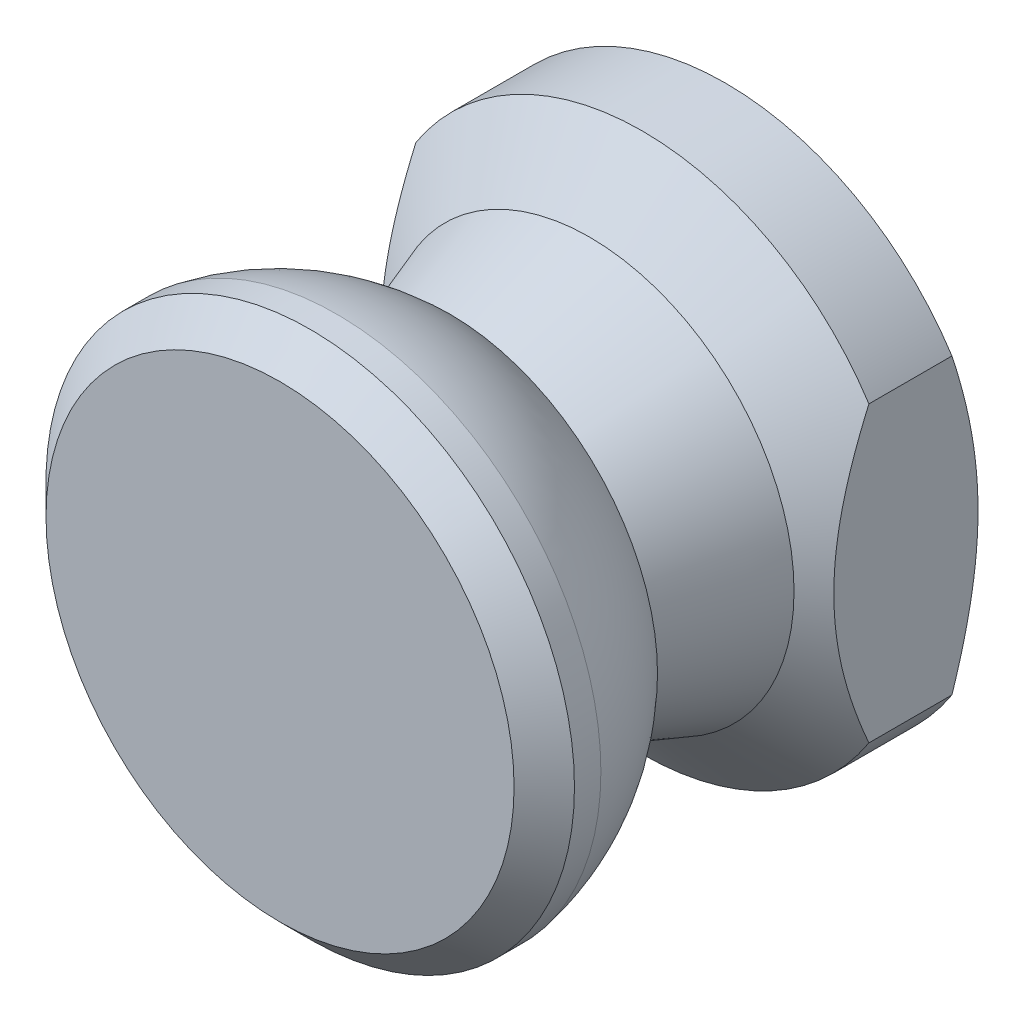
ISO-10303-21;
HEADER;
FILE_DESCRIPTION(('STEP AP214'),'2;1');
FILE_NAME('part.step','',(''),(''),'','','');
FILE_SCHEMA(('AUTOMOTIVE_DESIGN { 1 0 10303 214 1 1 1 1 }'));
ENDSEC;
DATA;
#1=APPLICATION_CONTEXT('core data for automotive mechanical design processes');
#2=APPLICATION_PROTOCOL_DEFINITION('international standard','automotive_design',2000,#1);
#3=PRODUCT_CONTEXT('',#1,'mechanical');
#4=PRODUCT('Part','Part','',(#3));
#5=PRODUCT_RELATED_PRODUCT_CATEGORY('part','',(#4));
#6=PRODUCT_DEFINITION_FORMATION('','',#4);
#7=PRODUCT_DEFINITION_CONTEXT('part definition',#1,'design');
#8=PRODUCT_DEFINITION('design','',#6,#7);
#9=PRODUCT_DEFINITION_SHAPE('','',#8);
#10=(LENGTH_UNIT() NAMED_UNIT(*) SI_UNIT(.MILLI.,.METRE.));
#11=(NAMED_UNIT(*) PLANE_ANGLE_UNIT() SI_UNIT($,.RADIAN.));
#12=(NAMED_UNIT(*) SI_UNIT($,.STERADIAN.) SOLID_ANGLE_UNIT());
#13=UNCERTAINTY_MEASURE_WITH_UNIT(LENGTH_MEASURE(1.E-05),#10,'distance_accuracy_value','');
#14=(GEOMETRIC_REPRESENTATION_CONTEXT(3) GLOBAL_UNCERTAINTY_ASSIGNED_CONTEXT((#13)) GLOBAL_UNIT_ASSIGNED_CONTEXT((#10,
#11,#12)) REPRESENTATION_CONTEXT('',''));
#15=CARTESIAN_POINT('',(0.,0.,0.));
#16=DIRECTION('',(0.,0.,1.));
#17=DIRECTION('',(1.,0.,0.));
#18=AXIS2_PLACEMENT_3D('',#15,#16,#17);
#19=CARTESIAN_POINT('',(0.,0.,15.5));
#20=DIRECTION('',(0.,0.,1.));
#21=DIRECTION('',(1.,0.,0.));
#22=AXIS2_PLACEMENT_3D('',#19,#20,#21);
#23=CYLINDRICAL_SURFACE('',#22,7.15);
#24=DIRECTION('',(0.,0.,1.));
#25=VECTOR('',#24,1.);
#26=CARTESIAN_POINT('',(-6.,3.88876587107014,15.5));
#27=LINE('',#26,#25);
#28=CARTESIAN_POINT('',(-6.,3.88876587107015,3.4));
#29=VERTEX_POINT('',#28);
#30=CARTESIAN_POINT('',(-6.,3.88876587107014,1.2));
#31=VERTEX_POINT('',#30);
#32=EDGE_CURVE('E60',#29,#31,#27,.F.);
#33=ORIENTED_EDGE('',*,*,#32,.F.);
#34=CARTESIAN_POINT('',(0.,0.,3.4));
#35=DIRECTION('',(0.,0.,1.));
#36=DIRECTION('',(1.,0.,0.));
#37=AXIS2_PLACEMENT_3D('',#34,#35,#36);
#38=CIRCLE('',#37,7.15);
#39=CARTESIAN_POINT('',(6.,3.88876587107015,3.4));
#40=VERTEX_POINT('',#39);
#41=EDGE_CURVE('E68',#40,#29,#38,.T.);
#42=ORIENTED_EDGE('',*,*,#41,.F.);
#43=DIRECTION('',(0.,0.,1.));
#44=VECTOR('',#43,1.);
#45=CARTESIAN_POINT('',(6.,3.88876587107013,15.5));
#46=LINE('',#45,#44);
#47=CARTESIAN_POINT('',(6.,3.88876587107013,1.2));
#48=VERTEX_POINT('',#47);
#49=EDGE_CURVE('E42',#48,#40,#46,.T.);
#50=ORIENTED_EDGE('',*,*,#49,.F.);
#51=CARTESIAN_POINT('',(0.,0.,1.20000000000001));
#52=DIRECTION('',(0.,0.,1.));
#53=DIRECTION('',(1.,0.,0.));
#54=AXIS2_PLACEMENT_3D('',#51,#52,#53);
#55=CIRCLE('',#54,7.15);
#56=EDGE_CURVE('E70',#48,#31,#55,.T.);
#57=ORIENTED_EDGE('',*,*,#56,.T.);
#58=EDGE_LOOP('',(#33,#42,#50,#57));
#59=FACE_BOUND('',#58,.T.);
#60=ADVANCED_FACE('F14',(#59),#23,.T.);
#61=CARTESIAN_POINT('',(3.,0.,0.));
#62=DIRECTION('',(0.,0.,-1.));
#63=DIRECTION('',(-1.,0.,0.));
#64=AXIS2_PLACEMENT_3D('',#61,#62,#63);
#65=PLANE('',#64);
#66=CARTESIAN_POINT('',(0.,0.,0.));
#67=DIRECTION('',(0.,0.,1.));
#68=DIRECTION('',(1.,0.,0.));
#69=AXIS2_PLACEMENT_3D('',#66,#67,#68);
#70=CIRCLE('',#69,3.);
#71=CARTESIAN_POINT('',(3.,0.,0.));
#72=VERTEX_POINT('',#71);
#73=EDGE_CURVE('E141',#72,#72,#70,.T.);
#74=ORIENTED_EDGE('',*,*,#73,.T.);
#75=EDGE_LOOP('',(#74));
#76=FACE_BOUND('',#75,.T.);
#77=CARTESIAN_POINT('',(0.,0.,0.));
#78=DIRECTION('',(0.,0.,1.));
#79=DIRECTION('',(1.,0.,0.));
#80=AXIS2_PLACEMENT_3D('',#77,#78,#79);
#81=CIRCLE('',#80,5.15);
#82=CARTESIAN_POINT('',(5.15,0.,0.));
#83=VERTEX_POINT('',#82);
#84=EDGE_CURVE('E83',#83,#83,#81,.T.);
#85=ORIENTED_EDGE('',*,*,#84,.F.);
#86=EDGE_LOOP('',(#85));
#87=FACE_BOUND('',#86,.T.);
#88=ADVANCED_FACE('F16',(#76,#87),#65,.T.);
#89=CARTESIAN_POINT('',(0.,0.,1.20000000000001));
#90=DIRECTION('',(0.,0.,1.));
#91=DIRECTION('',(1.,0.,0.));
#92=AXIS2_PLACEMENT_3D('',#89,#90,#91);
#93=CONICAL_SURFACE('',#92,7.15,1.03037682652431);
#94=CARTESIAN_POINT('',(-6.,-10.2804051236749,4.05193409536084));
#95=CARTESIAN_POINT('',(-6.,-10.0101252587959,3.91190550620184));
#96=CARTESIAN_POINT('',(-6.,-9.73929005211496,3.77293434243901));
#97=CARTESIAN_POINT('',(-6.,-9.19621625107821,3.49768733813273));
#98=CARTESIAN_POINT('',(-6.,-8.92397750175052,3.36141180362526));
#99=CARTESIAN_POINT('',(-6.,-8.37674762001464,3.09161761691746));
#100=CARTESIAN_POINT('',(-6.,-8.10174978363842,2.95811252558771));
#101=CARTESIAN_POINT('',(-6.,-7.54977127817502,2.69528259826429));
#102=CARTESIAN_POINT('',(-6.,-7.2727906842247,2.56595760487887));
#103=CARTESIAN_POINT('',(-6.,-6.70311560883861,2.30652249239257));
#104=CARTESIAN_POINT('',(-6.,-6.41030304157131,2.17667052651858));
#105=CARTESIAN_POINT('',(-6.,-5.82141885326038,1.92444844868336));
#106=CARTESIAN_POINT('',(-6.,-5.52534690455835,1.80207909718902));
#107=CARTESIAN_POINT('',(-6.00000000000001,-4.92975194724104,1.56733308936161));
#108=CARTESIAN_POINT('',(-6.00000000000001,-4.63023480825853,1.45494165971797));
#109=CARTESIAN_POINT('',(-6.,-4.02669661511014,1.24308099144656));
#110=CARTESIAN_POINT('',(-6.,-3.72267677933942,1.14360832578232));
#111=CARTESIAN_POINT('',(-6.,-3.11218998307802,0.962376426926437));
#112=CARTESIAN_POINT('',(-6.,-2.80576682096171,0.880471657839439));
#113=CARTESIAN_POINT('',(-6.00000000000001,-2.18787306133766,0.738061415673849));
#114=CARTESIAN_POINT('',(-6.00000000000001,-1.8764032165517,0.677552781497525));
#115=CARTESIAN_POINT('',(-6.00000000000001,-1.40883799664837,0.606823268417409));
#116=CARTESIAN_POINT('',(-6.00000000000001,-1.25421690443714,0.586673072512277));
#117=CARTESIAN_POINT('',(-6.00000000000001,-0.944247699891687,0.55316085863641));
#118=CARTESIAN_POINT('',(-6.00000000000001,-0.788899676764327,0.539798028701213));
#119=CARTESIAN_POINT('',(-6.00000000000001,-0.477751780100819,0.520201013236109));
#120=CARTESIAN_POINT('',(-6.00000000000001,-0.321951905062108,0.513966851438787));
#121=CARTESIAN_POINT('',(-6.,-0.0102294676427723,0.508791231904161));
#122=CARTESIAN_POINT('',(-6.,0.145693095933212,0.509849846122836));
#123=CARTESIAN_POINT('',(-6.,0.466240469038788,0.519503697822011));
#124=CARTESIAN_POINT('',(-6.,0.630852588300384,0.528526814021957));
#125=CARTESIAN_POINT('',(-6.00000000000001,0.959443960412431,0.55442406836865));
#126=CARTESIAN_POINT('',(-6.00000000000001,1.12342320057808,0.571298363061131));
#127=CARTESIAN_POINT('',(-6.00000000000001,1.6139969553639,0.6330449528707));
#128=CARTESIAN_POINT('',(-6.00000000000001,1.93924359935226,0.689041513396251));
#129=CARTESIAN_POINT('',(-6.00000000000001,2.42660923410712,0.792166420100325));
#130=CARTESIAN_POINT('',(-6.00000000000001,2.59076121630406,0.830252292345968));
#131=CARTESIAN_POINT('',(-6.00000000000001,2.9176629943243,0.912082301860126));
#132=CARTESIAN_POINT('',(-6.00000000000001,3.08041277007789,0.955826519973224));
#133=CARTESIAN_POINT('',(-6.00000000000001,3.40448415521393,1.04826779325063));
#134=CARTESIAN_POINT('',(-6.00000000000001,3.5658057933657,1.09696474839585));
#135=CARTESIAN_POINT('',(-6.,3.88706768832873,1.19866598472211));
#136=CARTESIAN_POINT('',(-6.,4.04700803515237,1.25166998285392));
#137=CARTESIAN_POINT('',(-6.,4.57938707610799,1.43501686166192));
#138=CARTESIAN_POINT('',(-6.,4.94896086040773,1.57369296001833));
#139=CARTESIAN_POINT('',(-6.00000000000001,5.68238513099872,1.86551627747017));
#140=CARTESIAN_POINT('',(-6.00000000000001,6.04623362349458,2.01866841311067));
#141=CARTESIAN_POINT('',(-6.,6.76975478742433,2.33555397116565));
#142=CARTESIAN_POINT('',(-6.,7.1294223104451,2.49929908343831));
#143=CARTESIAN_POINT('',(-6.,7.84511641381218,2.83439934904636));
#144=CARTESIAN_POINT('',(-6.,8.20114345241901,3.00575352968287));
#145=CARTESIAN_POINT('',(-6.,8.91188025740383,3.35490071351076));
#146=CARTESIAN_POINT('',(-6.,9.26657814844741,3.53271780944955));
#147=CARTESIAN_POINT('',(-6.,9.97374650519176,3.89273820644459));
#148=CARTESIAN_POINT('',(-6.,10.3262169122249,4.07494162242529));
#149=CARTESIAN_POINT('',(-6.,11.0291543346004,4.44263223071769));
#150=CARTESIAN_POINT('',(-6.,11.3796224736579,4.62811727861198));
#151=CARTESIAN_POINT('',(-6.,12.0791194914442,5.00176971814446));
#152=CARTESIAN_POINT('',(-6.,12.4281483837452,5.18993708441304));
#153=CARTESIAN_POINT('',(-6.,13.3799615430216,5.70685282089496));
#154=CARTESIAN_POINT('',(-6.,13.9815845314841,6.03773845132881));
#155=CARTESIAN_POINT('',(-6.,15.1824389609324,6.70406103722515));
#156=CARTESIAN_POINT('',(-6.,15.7816699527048,7.03949879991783));
#157=CARTESIAN_POINT('',(-6.,16.973504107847,7.7109697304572));
#158=CARTESIAN_POINT('',(-6.,17.5661219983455,8.04697677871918));
#159=CARTESIAN_POINT('',(-6.,18.4539477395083,8.55277746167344));
#160=CARTESIAN_POINT('',(-6.,18.7496761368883,8.72165878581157));
#161=CARTESIAN_POINT('',(-6.,19.3408253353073,9.05995778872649));
#162=CARTESIAN_POINT('',(-6.,19.636246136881,9.22937546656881));
#163=CARTESIAN_POINT('',(-6.,19.9315332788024,9.39902585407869));
#164=B_SPLINE_CURVE_WITH_KNOTS('',3,(#94,#95,#96,#97,#98,#99,#100,#101,#102,#103,#104,#105,#106,
#107,#108,#109,#110,#111,#112,#113,#114,#115,#116,#117,#118,#119,#120,#121,#122,#123,#124,#125,
#126,#127,#128,#129,#130,#131,#132,#133,#134,#135,#136,#137,#138,#139,#140,#141,#142,#143,#144,
#145,#146,#147,#148,#149,#150,#151,#152,#153,#154,#155,#156,#157,#158,#159,#160,#161,#162,#163),
.UNSPECIFIED.,.F.,.F.,(4,2,2,2,2,2,2,2,2,2,2,2,2,2,2,2,2,2,2,2,2,2,2,2,2,2,2,2,2,2,2,2,2,2,4),
(0.,0.913206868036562,1.82651682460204,2.74356353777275,3.66057568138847,4.62143647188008,
5.58239475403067,6.54190564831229,7.50116148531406,8.45213430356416,9.4029665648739,
9.87062638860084,10.3382302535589,10.8058356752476,11.2734457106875,11.7678186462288,
12.262201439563,13.2509188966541,13.7563888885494,14.2618661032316,14.7673331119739,
15.2727669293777,16.4564716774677,17.6405799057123,18.8260179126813,20.011304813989,
21.2015870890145,22.3919005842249,23.5814630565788,24.7710142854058,26.8308179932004,
28.8909918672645,30.9347229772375,31.9563808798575,32.9780370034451),.UNSPECIFIED.);
#165=CARTESIAN_POINT('',(-6.,-3.88876587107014,1.2));
#166=VERTEX_POINT('',#165);
#167=EDGE_CURVE('E71',#31,#166,#164,.F.);
#168=ORIENTED_EDGE('',*,*,#167,.F.);
#169=ORIENTED_EDGE('',*,*,#56,.F.);
#170=CARTESIAN_POINT('',(6.,-10.2804051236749,4.05193409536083));
#171=CARTESIAN_POINT('',(6.,-10.0101252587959,3.91190550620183));
#172=CARTESIAN_POINT('',(6.,-9.73929005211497,3.77293434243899));
#173=CARTESIAN_POINT('',(6.,-9.19621625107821,3.49768733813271));
#174=CARTESIAN_POINT('',(6.,-8.92397750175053,3.36141180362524));
#175=CARTESIAN_POINT('',(6.,-8.37674762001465,3.09161761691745));
#176=CARTESIAN_POINT('',(6.,-8.10174978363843,2.9581125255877));
#177=CARTESIAN_POINT('',(6.,-7.54977127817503,2.69528259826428));
#178=CARTESIAN_POINT('',(6.,-7.27279068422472,2.56595760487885));
#179=CARTESIAN_POINT('',(6.,-6.70311560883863,2.30652249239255));
#180=CARTESIAN_POINT('',(6.,-6.41030304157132,2.17667052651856));
#181=CARTESIAN_POINT('',(6.,-5.82141885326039,1.92444844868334));
#182=CARTESIAN_POINT('',(6.,-5.52534690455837,1.802079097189));
#183=CARTESIAN_POINT('',(5.99999999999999,-4.92975194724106,1.56733308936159));
#184=CARTESIAN_POINT('',(5.99999999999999,-4.63023480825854,1.45494165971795));
#185=CARTESIAN_POINT('',(6.,-4.02669661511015,1.24308099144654));
#186=CARTESIAN_POINT('',(6.,-3.72267677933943,1.14360832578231));
#187=CARTESIAN_POINT('',(6.,-3.11218998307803,0.962376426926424));
#188=CARTESIAN_POINT('',(6.,-2.80576682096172,0.880471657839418));
#189=CARTESIAN_POINT('',(5.99999999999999,-2.18787306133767,0.738061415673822));
#190=CARTESIAN_POINT('',(5.99999999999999,-1.87640321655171,0.6775527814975));
#191=CARTESIAN_POINT('',(5.99999999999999,-1.40883799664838,0.606823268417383));
#192=CARTESIAN_POINT('',(5.99999999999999,-1.25421690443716,0.58667307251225));
#193=CARTESIAN_POINT('',(5.99999999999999,-0.944247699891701,0.553160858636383));
#194=CARTESIAN_POINT('',(5.99999999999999,-0.788899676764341,0.539798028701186));
#195=CARTESIAN_POINT('',(5.99999999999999,-0.477751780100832,0.520201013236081));
#196=CARTESIAN_POINT('',(5.99999999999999,-0.321951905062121,0.513966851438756));
#197=CARTESIAN_POINT('',(6.,-0.0102294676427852,0.508791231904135));
#198=CARTESIAN_POINT('',(6.,0.145693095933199,0.509849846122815));
#199=CARTESIAN_POINT('',(6.,0.466240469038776,0.51950369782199));
#200=CARTESIAN_POINT('',(6.,0.630852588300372,0.52852681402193));
#201=CARTESIAN_POINT('',(5.99999999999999,0.95944396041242,0.554424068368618));
#202=CARTESIAN_POINT('',(5.99999999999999,1.12342320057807,0.5712983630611));
#203=CARTESIAN_POINT('',(5.99999999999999,1.61399695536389,0.633044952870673));
#204=CARTESIAN_POINT('',(5.99999999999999,1.93924359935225,0.689041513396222));
#205=CARTESIAN_POINT('',(5.99999999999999,2.42660923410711,0.792166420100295));
#206=CARTESIAN_POINT('',(5.99999999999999,2.59076121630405,0.830252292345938));
#207=CARTESIAN_POINT('',(5.99999999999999,2.91766299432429,0.912082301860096));
#208=CARTESIAN_POINT('',(5.99999999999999,3.08041277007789,0.955826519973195));
#209=CARTESIAN_POINT('',(5.99999999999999,3.40448415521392,1.0482677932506));
#210=CARTESIAN_POINT('',(5.99999999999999,3.56580579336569,1.09696474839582));
#211=CARTESIAN_POINT('',(6.,3.88706768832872,1.19866598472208));
#212=CARTESIAN_POINT('',(6.,4.04700803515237,1.2516699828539));
#213=CARTESIAN_POINT('',(6.,4.57938707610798,1.4350168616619));
#214=CARTESIAN_POINT('',(6.,4.94896086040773,1.57369296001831));
#215=CARTESIAN_POINT('',(5.99999999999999,5.68238513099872,1.86551627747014));
#216=CARTESIAN_POINT('',(5.99999999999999,6.04623362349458,2.01866841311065));
#217=CARTESIAN_POINT('',(6.,6.76975478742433,2.33555397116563));
#218=CARTESIAN_POINT('',(6.,7.1294223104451,2.49929908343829));
#219=CARTESIAN_POINT('',(6.,7.84511641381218,2.83439934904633));
#220=CARTESIAN_POINT('',(6.,8.20114345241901,3.00575352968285));
#221=CARTESIAN_POINT('',(6.,8.91188025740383,3.35490071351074));
#222=CARTESIAN_POINT('',(6.,9.26657814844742,3.53271780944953));
#223=CARTESIAN_POINT('',(6.,9.97374650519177,3.89273820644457));
#224=CARTESIAN_POINT('',(6.,10.3262169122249,4.07494162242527));
#225=CARTESIAN_POINT('',(6.,11.0291543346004,4.44263223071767));
#226=CARTESIAN_POINT('',(6.,11.3796224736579,4.62811727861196));
#227=CARTESIAN_POINT('',(6.,12.0791194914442,5.00176971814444));
#228=CARTESIAN_POINT('',(6.,12.4281483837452,5.18993708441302));
#229=CARTESIAN_POINT('',(6.,13.3799615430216,5.70685282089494));
#230=CARTESIAN_POINT('',(6.,13.9815845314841,6.03773845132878));
#231=CARTESIAN_POINT('',(6.,15.1824389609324,6.70406103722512));
#232=CARTESIAN_POINT('',(6.,15.7816699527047,7.03949879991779));
#233=CARTESIAN_POINT('',(6.,16.9735041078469,7.71096973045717));
#234=CARTESIAN_POINT('',(6.,17.5661219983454,8.04697677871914));
#235=CARTESIAN_POINT('',(6.,18.4539477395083,8.5527774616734));
#236=CARTESIAN_POINT('',(6.,18.7496761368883,8.72165878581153));
#237=CARTESIAN_POINT('',(6.,19.3408253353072,9.05995778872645));
#238=CARTESIAN_POINT('',(6.,19.636246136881,9.22937546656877));
#239=CARTESIAN_POINT('',(6.,19.9315332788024,9.39902585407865));
#240=B_SPLINE_CURVE_WITH_KNOTS('',3,(#170,#171,#172,#173,#174,#175,#176,#177,#178,#179,#180,
#181,#182,#183,#184,#185,#186,#187,#188,#189,#190,#191,#192,#193,#194,#195,#196,#197,#198,#199,
#200,#201,#202,#203,#204,#205,#206,#207,#208,#209,#210,#211,#212,#213,#214,#215,#216,#217,#218,
#219,#220,#221,#222,#223,#224,#225,#226,#227,#228,#229,#230,#231,#232,#233,#234,#235,#236,#237,
#238,#239),.UNSPECIFIED.,.F.,.F.,(4,2,2,2,2,2,2,2,2,2,2,2,2,2,2,2,2,2,2,2,2,2,2,2,2,2,2,2,2,2,2,
2,2,2,4),(0.,0.913206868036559,1.82651682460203,2.74356353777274,3.66057568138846,
4.62143647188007,5.58239475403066,6.54190564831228,7.50116148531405,8.45213430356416,
9.40296656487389,9.87062638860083,10.3382302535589,10.8058356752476,11.2734457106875,
11.7678186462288,12.262201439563,13.250918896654,13.7563888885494,14.2618661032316,
14.7673331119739,15.2727669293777,16.4564716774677,17.6405799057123,18.8260179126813,
20.011304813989,21.2015870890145,22.3919005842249,23.5814630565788,24.7710142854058,
26.8308179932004,28.8909918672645,30.9347229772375,31.9563808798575,32.978037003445),.UNSPECIFIED.);
#241=CARTESIAN_POINT('',(6.,-3.88876587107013,1.2));
#242=VERTEX_POINT('',#241);
#243=EDGE_CURVE('E109',#242,#48,#240,.T.);
#244=ORIENTED_EDGE('',*,*,#243,.F.);
#245=EDGE_CURVE('E75',#166,#242,#55,.T.);
#246=ORIENTED_EDGE('',*,*,#245,.F.);
#247=EDGE_LOOP('',(#168,#169,#244,#246));
#248=FACE_BOUND('',#247,.T.);
#249=ORIENTED_EDGE('',*,*,#84,.T.);
#250=EDGE_LOOP('',(#249));
#251=FACE_BOUND('',#250,.T.);
#252=ADVANCED_FACE('F102',(#248,#251),#93,.T.);
#253=DIRECTION('',(0.,0.,1.));
#254=VECTOR('',#253,1.);
#255=CARTESIAN_POINT('',(-6.,-3.88876587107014,15.5));
#256=LINE('',#255,#254);
#257=CARTESIAN_POINT('',(-6.,-3.88876587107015,3.4));
#258=VERTEX_POINT('',#257);
#259=EDGE_CURVE('E34',#166,#258,#256,.T.);
#260=ORIENTED_EDGE('',*,*,#259,.F.);
#261=ORIENTED_EDGE('',*,*,#245,.T.);
#262=DIRECTION('',(0.,0.,1.));
#263=VECTOR('',#262,1.);
#264=CARTESIAN_POINT('',(6.,-3.88876587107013,15.5));
#265=LINE('',#264,#263);
#266=CARTESIAN_POINT('',(6.,-3.88876587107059,3.40000000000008));
#267=VERTEX_POINT('',#266);
#268=EDGE_CURVE('E149',#267,#242,#265,.F.);
#269=ORIENTED_EDGE('',*,*,#268,.F.);
#270=EDGE_CURVE('E76',#258,#267,#38,.T.);
#271=ORIENTED_EDGE('',*,*,#270,.F.);
#272=EDGE_LOOP('',(#260,#261,#269,#271));
#273=FACE_BOUND('',#272,.T.);
#274=ADVANCED_FACE('F98',(#273),#23,.T.);
#275=CARTESIAN_POINT('',(0.,0.,4.8));
#276=DIRECTION('',(0.,0.,-1.));
#277=DIRECTION('',(-1.,0.,0.));
#278=AXIS2_PLACEMENT_3D('',#275,#276,#277);
#279=CONICAL_SURFACE('',#278,5.41666666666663,0.891382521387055);
#280=CARTESIAN_POINT('',(-6.,-10.0021143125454,-0.245694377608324));
#281=CARTESIAN_POINT('',(-6.,-9.75023490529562,-0.071272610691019));
#282=CARTESIAN_POINT('',(-6.00000000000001,-9.49756585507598,0.102023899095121));
#283=CARTESIAN_POINT('',(-6.00000000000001,-8.99023413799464,0.445756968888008));
#284=CARTESIAN_POINT('',(-6.00000000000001,-8.73557116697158,0.616193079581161));
#285=CARTESIAN_POINT('',(-6.00000000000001,-8.22228758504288,0.954614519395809));
#286=CARTESIAN_POINT('',(-6.00000000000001,-7.96365210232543,1.12257735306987));
#287=CARTESIAN_POINT('',(-6.00000000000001,-7.44353248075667,1.45400999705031));
#288=CARTESIAN_POINT('',(-6.00000000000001,-7.18204850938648,1.61748006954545));
#289=CARTESIAN_POINT('',(-6.00000000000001,-6.63288996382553,1.95258278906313));
#290=CARTESIAN_POINT('',(-6.00000000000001,-6.34490156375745,2.1237034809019));
#291=CARTESIAN_POINT('',(-6.,-5.76374773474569,2.4571114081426));
#292=CARTESIAN_POINT('',(-6.,-5.47058133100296,2.61939695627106));
#293=CARTESIAN_POINT('',(-6.,-4.87862882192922,2.93164480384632));
#294=CARTESIAN_POINT('',(-6.,-4.57985817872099,3.08163621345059));
#295=CARTESIAN_POINT('',(-6.,-3.97471882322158,3.36535789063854));
#296=CARTESIAN_POINT('',(-6.,-3.66835386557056,3.49909600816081));
#297=CARTESIAN_POINT('',(-6.,-3.21577601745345,3.6775880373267));
#298=CARTESIAN_POINT('',(-6.,-3.07305072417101,3.73118908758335));
#299=CARTESIAN_POINT('',(-6.,-2.7857085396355,3.83301654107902));
#300=CARTESIAN_POINT('',(-6.,-2.64109166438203,3.8812429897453));
#301=CARTESIAN_POINT('',(-6.,-2.20434779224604,4.01669494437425));
#302=CARTESIAN_POINT('',(-6.,-1.90921737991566,4.09473772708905));
#303=CARTESIAN_POINT('',(-6.,-1.46556818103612,4.18766223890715));
#304=CARTESIAN_POINT('',(-6.,-1.31947841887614,4.21441021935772));
#305=CARTESIAN_POINT('',(-6.,-1.02606296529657,4.25986870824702));
#306=CARTESIAN_POINT('',(-6.,-0.878737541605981,4.27858091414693));
#307=CARTESIAN_POINT('',(-6.,-0.583272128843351,4.30744220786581));
#308=CARTESIAN_POINT('',(-6.,-0.435132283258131,4.31759275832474));
#309=CARTESIAN_POINT('',(-6.,-0.138511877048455,4.32903147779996));
#310=CARTESIAN_POINT('',(-6.,0.00996866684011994,4.33032007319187));
#311=CARTESIAN_POINT('',(-6.,0.285362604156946,4.32445265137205));
#312=CARTESIAN_POINT('',(-6.,0.412302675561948,4.31848597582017));
#313=CARTESIAN_POINT('',(-6.,0.665726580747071,4.30017420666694));
#314=CARTESIAN_POINT('',(-6.,0.792210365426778,4.28782844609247));
#315=CARTESIAN_POINT('',(-6.,1.17049937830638,4.24158809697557));
#316=CARTESIAN_POINT('',(-6.,1.42121709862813,4.19848860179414));
#317=CARTESIAN_POINT('',(-6.,1.92455868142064,4.08952696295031));
#318=CARTESIAN_POINT('',(-6.,2.17705405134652,4.02308662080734));
#319=CARTESIAN_POINT('',(-6.,2.55151908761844,3.90968542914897));
#320=CARTESIAN_POINT('',(-6.,2.67563149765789,3.86959348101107));
#321=CARTESIAN_POINT('',(-6.,2.92244986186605,3.78531245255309));
#322=CARTESIAN_POINT('',(-6.,3.04515590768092,3.74112364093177));
#323=CARTESIAN_POINT('',(-6.,3.4173991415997,3.6007769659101));
#324=CARTESIAN_POINT('',(-6.,3.6647461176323,3.49879456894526));
#325=CARTESIAN_POINT('',(-6.,4.15424069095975,3.28296049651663));
#326=CARTESIAN_POINT('',(-6.,4.39638623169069,3.16910422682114));
#327=CARTESIAN_POINT('',(-6.,4.87645273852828,2.93202043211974));
#328=CARTESIAN_POINT('',(-6.,5.11436711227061,2.80877963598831));
#329=CARTESIAN_POINT('',(-6.,5.58626736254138,2.55510591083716));
#330=CARTESIAN_POINT('',(-6.,5.82025373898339,2.42467390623));
#331=CARTESIAN_POINT('',(-6.,6.28649880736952,2.15722911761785));
#332=CARTESIAN_POINT('',(-6.,6.51873556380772,2.02017824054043));
#333=CARTESIAN_POINT('',(-6.,6.98042830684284,1.74147153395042));
#334=CARTESIAN_POINT('',(-6.00000000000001,7.20988422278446,1.59981558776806));
#335=CARTESIAN_POINT('',(-6.00000000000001,7.66627612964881,1.31290125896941));
#336=CARTESIAN_POINT('',(-6.00000000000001,7.8932139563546,1.16764578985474));
#337=CARTESIAN_POINT('',(-6.00000000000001,8.34511962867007,0.874098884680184));
#338=CARTESIAN_POINT('',(-6.00000000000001,8.57008743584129,0.725807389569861));
#339=CARTESIAN_POINT('',(-6.00000000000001,9.18302546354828,0.316866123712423));
#340=CARTESIAN_POINT('',(-6.00000000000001,9.56932289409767,0.0537099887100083));
#341=CARTESIAN_POINT('',(-6.00000000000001,10.3381788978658,-0.478145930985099));
#342=CARTESIAN_POINT('',(-6.00000000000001,10.7207367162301,-0.746846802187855));
#343=CARTESIAN_POINT('',(-6.00000000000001,11.4777233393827,-1.28473082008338));
#344=CARTESIAN_POINT('',(-6.00000000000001,11.8521920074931,-1.55385793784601));
#345=CARTESIAN_POINT('',(-6.00000000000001,12.4121352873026,-1.95986322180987));
#346=CARTESIAN_POINT('',(-6.00000000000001,12.598464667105,-2.09556556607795));
#347=CARTESIAN_POINT('',(-6.00000000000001,12.9706107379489,-2.36766923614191));
#348=CARTESIAN_POINT('',(-6.00000000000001,13.1564274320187,-2.50407055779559));
#349=CARTESIAN_POINT('',(-6.,13.3420172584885,-2.64078000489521));
#350=B_SPLINE_CURVE_WITH_KNOTS('',3,(#280,#281,#282,#283,#284,#285,#286,#287,#288,#289,#290,
#291,#292,#293,#294,#295,#296,#297,#298,#299,#300,#301,#302,#303,#304,#305,#306,#307,#308,#309,
#310,#311,#312,#313,#314,#315,#316,#317,#318,#319,#320,#321,#322,#323,#324,#325,#326,#327,#328,
#329,#330,#331,#332,#333,#334,#335,#336,#337,#338,#339,#340,#341,#342,#343,#344,#345,#346,#347,
#348,#349),.UNSPECIFIED.,.F.,.F.,(4,2,2,2,2,2,2,2,2,2,2,2,2,2,2,2,2,2,2,2,2,2,2,2,2,2,2,2,2,2,2,
2,2,2,4),(0.,0.919137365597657,1.8384177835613,2.76354769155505,3.68862349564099,
4.69348307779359,5.69853389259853,6.70113171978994,7.70324337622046,8.16051951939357,
8.61779179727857,9.53198060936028,9.9773567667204,10.4226387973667,10.8678447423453,
11.313029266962,11.6941051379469,12.0752208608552,12.8372287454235,13.6196254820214,
14.0108478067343,14.4020444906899,15.2042352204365,16.0067374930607,16.8103964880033,
17.6139524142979,18.4228683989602,19.2318048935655,20.0401067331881,20.8484243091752,
22.2505965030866,23.6530461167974,25.0364636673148,25.7279853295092,26.4195028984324),.UNSPECIFIED.);
#351=EDGE_CURVE('E9',#258,#29,#350,.T.);
#352=ORIENTED_EDGE('',*,*,#351,.F.);
#353=ORIENTED_EDGE('',*,*,#270,.T.);
#354=CARTESIAN_POINT('',(6.,-10.0021143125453,-0.245694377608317));
#355=CARTESIAN_POINT('',(6.,-9.75023490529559,-0.0712726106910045));
#356=CARTESIAN_POINT('',(5.99999999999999,-9.49756585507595,0.102023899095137));
#357=CARTESIAN_POINT('',(5.99999999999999,-8.99023413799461,0.445756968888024));
#358=CARTESIAN_POINT('',(5.99999999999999,-8.73557116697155,0.616193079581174));
#359=CARTESIAN_POINT('',(5.99999999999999,-8.22228758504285,0.954614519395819));
#360=CARTESIAN_POINT('',(5.99999999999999,-7.9636521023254,1.12257735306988));
#361=CARTESIAN_POINT('',(5.99999999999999,-7.44353248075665,1.45400999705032));
#362=CARTESIAN_POINT('',(5.99999999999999,-7.18204850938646,1.61748006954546));
#363=CARTESIAN_POINT('',(5.99999999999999,-6.63288996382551,1.95258278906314));
#364=CARTESIAN_POINT('',(5.99999999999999,-6.34490156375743,2.1237034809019));
#365=CARTESIAN_POINT('',(6.,-5.76374773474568,2.4571114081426));
#366=CARTESIAN_POINT('',(6.,-5.47058133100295,2.61939695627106));
#367=CARTESIAN_POINT('',(6.,-4.87862882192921,2.93164480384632));
#368=CARTESIAN_POINT('',(6.,-4.57985817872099,3.0816362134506));
#369=CARTESIAN_POINT('',(6.,-3.97471882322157,3.36535789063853));
#370=CARTESIAN_POINT('',(6.,-3.66835386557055,3.49909600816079));
#371=CARTESIAN_POINT('',(6.,-3.21577601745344,3.67758803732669));
#372=CARTESIAN_POINT('',(6.,-3.07305072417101,3.73118908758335));
#373=CARTESIAN_POINT('',(6.,-2.7857085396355,3.83301654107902));
#374=CARTESIAN_POINT('',(6.,-2.64109166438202,3.88124298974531));
#375=CARTESIAN_POINT('',(6.,-2.20434779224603,4.01669494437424));
#376=CARTESIAN_POINT('',(6.,-1.90921737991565,4.09473772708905));
#377=CARTESIAN_POINT('',(6.,-1.46556818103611,4.18766223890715));
#378=CARTESIAN_POINT('',(6.,-1.31947841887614,4.21441021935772));
#379=CARTESIAN_POINT('',(6.,-1.02606296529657,4.25986870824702));
#380=CARTESIAN_POINT('',(6.,-0.878737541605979,4.27858091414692));
#381=CARTESIAN_POINT('',(6.,-0.583272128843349,4.30744220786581));
#382=CARTESIAN_POINT('',(6.,-0.435132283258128,4.31759275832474));
#383=CARTESIAN_POINT('',(6.,-0.138511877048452,4.32903147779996));
#384=CARTESIAN_POINT('',(6.,0.00996866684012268,4.33032007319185));
#385=CARTESIAN_POINT('',(6.,0.285362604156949,4.32445265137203));
#386=CARTESIAN_POINT('',(6.,0.412302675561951,4.31848597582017));
#387=CARTESIAN_POINT('',(6.,0.665726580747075,4.30017420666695));
#388=CARTESIAN_POINT('',(6.,0.792210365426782,4.28782844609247));
#389=CARTESIAN_POINT('',(6.,1.17049937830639,4.24158809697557));
#390=CARTESIAN_POINT('',(6.,1.42121709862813,4.19848860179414));
#391=CARTESIAN_POINT('',(6.,1.92455868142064,4.0895269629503));
#392=CARTESIAN_POINT('',(6.,2.17705405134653,4.02308662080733));
#393=CARTESIAN_POINT('',(6.,2.55151908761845,3.90968542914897));
#394=CARTESIAN_POINT('',(6.,2.6756314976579,3.86959348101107));
#395=CARTESIAN_POINT('',(6.,2.92244986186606,3.78531245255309));
#396=CARTESIAN_POINT('',(6.,3.04515590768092,3.74112364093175));
#397=CARTESIAN_POINT('',(6.,3.41739914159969,3.60077696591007));
#398=CARTESIAN_POINT('',(6.,3.6647461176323,3.49879456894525));
#399=CARTESIAN_POINT('',(6.,4.15424069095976,3.28296049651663));
#400=CARTESIAN_POINT('',(6.,4.3963862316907,3.16910422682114));
#401=CARTESIAN_POINT('',(6.,4.87645273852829,2.93202043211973));
#402=CARTESIAN_POINT('',(6.,5.11436711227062,2.8087796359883));
#403=CARTESIAN_POINT('',(6.,5.58626736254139,2.55510591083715));
#404=CARTESIAN_POINT('',(6.,5.8202537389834,2.42467390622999));
#405=CARTESIAN_POINT('',(6.,6.28649880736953,2.15722911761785));
#406=CARTESIAN_POINT('',(6.,6.51873556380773,2.02017824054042));
#407=CARTESIAN_POINT('',(6.,6.98042830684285,1.74147153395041));
#408=CARTESIAN_POINT('',(5.99999999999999,7.20988422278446,1.59981558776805));
#409=CARTESIAN_POINT('',(5.99999999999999,7.66627612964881,1.3129012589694));
#410=CARTESIAN_POINT('',(5.99999999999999,7.89321395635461,1.16764578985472));
#411=CARTESIAN_POINT('',(5.99999999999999,8.34511962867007,0.874098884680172));
#412=CARTESIAN_POINT('',(5.99999999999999,8.57008743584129,0.72580738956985));
#413=CARTESIAN_POINT('',(5.99999999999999,9.18302546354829,0.316866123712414));
#414=CARTESIAN_POINT('',(5.99999999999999,9.56932289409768,0.0537099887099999));
#415=CARTESIAN_POINT('',(5.99999999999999,10.3381788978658,-0.478145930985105));
#416=CARTESIAN_POINT('',(5.99999999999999,10.7207367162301,-0.746846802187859));
#417=CARTESIAN_POINT('',(5.99999999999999,11.4777233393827,-1.28473082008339));
#418=CARTESIAN_POINT('',(5.99999999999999,11.8521920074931,-1.55385793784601));
#419=CARTESIAN_POINT('',(5.99999999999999,12.4121352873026,-1.95986322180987));
#420=CARTESIAN_POINT('',(5.99999999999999,12.598464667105,-2.09556556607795));
#421=CARTESIAN_POINT('',(5.99999999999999,12.9706107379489,-2.36766923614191));
#422=CARTESIAN_POINT('',(5.99999999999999,13.1564274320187,-2.50407055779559));
#423=CARTESIAN_POINT('',(6.,13.3420172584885,-2.64078000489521));
#424=B_SPLINE_CURVE_WITH_KNOTS('',3,(#354,#355,#356,#357,#358,#359,#360,#361,#362,#363,#364,
#365,#366,#367,#368,#369,#370,#371,#372,#373,#374,#375,#376,#377,#378,#379,#380,#381,#382,#383,
#384,#385,#386,#387,#388,#389,#390,#391,#392,#393,#394,#395,#396,#397,#398,#399,#400,#401,#402,
#403,#404,#405,#406,#407,#408,#409,#410,#411,#412,#413,#414,#415,#416,#417,#418,#419,#420,#421,
#422,#423),.UNSPECIFIED.,.F.,.F.,(4,2,2,2,2,2,2,2,2,2,2,2,2,2,2,2,2,2,2,2,2,2,2,2,2,2,2,2,2,2,2,
2,2,2,4),(0.,0.919137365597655,1.83841778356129,2.76354769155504,3.68862349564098,
4.69348307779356,5.6985338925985,6.70113171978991,7.70324337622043,8.16051951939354,
8.61779179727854,9.53198060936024,9.97735676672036,10.4226387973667,10.8678447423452,
11.313029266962,11.6941051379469,12.0752208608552,12.8372287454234,13.6196254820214,
14.0108478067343,14.4020444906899,15.2042352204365,16.0067374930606,16.8103964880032,
17.6139524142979,18.4228683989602,19.2318048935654,20.0401067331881,20.8484243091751,
22.2505965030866,23.6530461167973,25.0364636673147,25.7279853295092,26.4195028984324),.UNSPECIFIED.);
#425=EDGE_CURVE('E28',#40,#267,#424,.F.);
#426=ORIENTED_EDGE('',*,*,#425,.F.);
#427=ORIENTED_EDGE('',*,*,#41,.T.);
#428=EDGE_LOOP('',(#352,#353,#426,#427));
#429=FACE_BOUND('',#428,.T.);
#430=CARTESIAN_POINT('',(0.,0.,4.8));
#431=DIRECTION('',(0.,0.,1.));
#432=DIRECTION('',(1.,0.,0.));
#433=AXIS2_PLACEMENT_3D('',#430,#431,#432);
#434=CIRCLE('',#433,5.41666666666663);
#435=CARTESIAN_POINT('',(5.41666666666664,0.,4.79999999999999));
#436=VERTEX_POINT('',#435);
#437=EDGE_CURVE('E79',#436,#436,#434,.T.);
#438=ORIENTED_EDGE('',*,*,#437,.F.);
#439=EDGE_LOOP('',(#438));
#440=FACE_BOUND('',#439,.T.);
#441=ADVANCED_FACE('F73',(#429,#440),#279,.T.);
#442=CARTESIAN_POINT('',(0.,0.,8.2));
#443=DIRECTION('',(0.,0.,-1.));
#444=DIRECTION('',(-1.,0.,0.));
#445=AXIS2_PLACEMENT_3D('',#442,#443,#444);
#446=CONICAL_SURFACE('',#445,4.2,0.343644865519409);
#447=ORIENTED_EDGE('',*,*,#437,.T.);
#448=EDGE_LOOP('',(#447));
#449=FACE_BOUND('',#448,.T.);
#450=CARTESIAN_POINT('',(0.,0.,8.2));
#451=DIRECTION('',(0.,0.,1.));
#452=DIRECTION('',(1.,0.,0.));
#453=AXIS2_PLACEMENT_3D('',#450,#451,#452);
#454=CIRCLE('',#453,4.2);
#455=CARTESIAN_POINT('',(4.20000000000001,0.,8.2));
#456=VERTEX_POINT('',#455);
#457=EDGE_CURVE('E164',#456,#456,#454,.T.);
#458=ORIENTED_EDGE('',*,*,#457,.F.);
#459=EDGE_LOOP('',(#458));
#460=FACE_BOUND('',#459,.T.);
#461=ADVANCED_FACE('F97',(#449,#460),#446,.T.);
#462=CARTESIAN_POINT('',(0.,0.,8.5));
#463=DIRECTION('',(0.,0.,1.));
#464=DIRECTION('',(1.,0.,0.));
#465=AXIS2_PLACEMENT_3D('',#462,#463,#464);
#466=CONICAL_SURFACE('',#465,4.5,0.78539816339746);
#467=ORIENTED_EDGE('',*,*,#457,.T.);
#468=EDGE_LOOP('',(#467));
#469=FACE_BOUND('',#468,.T.);
#470=CARTESIAN_POINT('',(0.,0.,8.5));
#471=DIRECTION('',(0.,0.,1.));
#472=DIRECTION('',(1.,0.,0.));
#473=AXIS2_PLACEMENT_3D('',#470,#471,#472);
#474=CIRCLE('',#473,4.5);
#475=CARTESIAN_POINT('',(4.50000000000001,0.,8.49999999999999));
#476=VERTEX_POINT('',#475);
#477=EDGE_CURVE('E162',#476,#476,#474,.T.);
#478=ORIENTED_EDGE('',*,*,#477,.F.);
#479=EDGE_LOOP('',(#478));
#480=FACE_BOUND('',#479,.T.);
#481=ADVANCED_FACE('F173',(#469,#480),#466,.T.);
#482=CARTESIAN_POINT('',(4.5,0.,8.5));
#483=DIRECTION('',(0.,0.,-1.));
#484=DIRECTION('',(-1.,0.,0.));
#485=AXIS2_PLACEMENT_3D('',#482,#483,#484);
#486=PLANE('',#485);
#487=ORIENTED_EDGE('',*,*,#477,.T.);
#488=EDGE_LOOP('',(#487));
#489=FACE_BOUND('',#488,.T.);
#490=CARTESIAN_POINT('',(0.,0.,8.5));
#491=DIRECTION('',(0.,0.,1.));
#492=DIRECTION('',(1.,0.,0.));
#493=AXIS2_PLACEMENT_3D('',#490,#491,#492);
#494=CIRCLE('',#493,5.5);
#495=CARTESIAN_POINT('',(5.50000000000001,0.,8.49999999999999));
#496=VERTEX_POINT('',#495);
#497=EDGE_CURVE('E159',#496,#496,#494,.T.);
#498=ORIENTED_EDGE('',*,*,#497,.F.);
#499=EDGE_LOOP('',(#498));
#500=FACE_BOUND('',#499,.T.);
#501=ADVANCED_FACE('F177',(#489,#500),#486,.T.);
#502=CARTESIAN_POINT('',(0.,0.,12.4891022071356));
#503=DIRECTION('',(0.,0.,1.));
#504=DIRECTION('',(1.,0.,0.));
#505=AXIS2_PLACEMENT_3D('',#502,#503,#504);
#506=DEGENERATE_TOROIDAL_SURFACE('',#505,1.27179486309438,5.812973,.T.);
#507=ORIENTED_EDGE('',*,*,#497,.T.);
#508=EDGE_LOOP('',(#507));
#509=FACE_BOUND('',#508,.T.);
#510=CARTESIAN_POINT('',(0.,0.,11.5000010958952));
#511=DIRECTION('',(0.,0.,1.));
#512=DIRECTION('',(1.,0.,0.));
#513=AXIS2_PLACEMENT_3D('',#510,#511,#512);
#514=CIRCLE('',#513,7.);
#515=CARTESIAN_POINT('',(7.00000000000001,0.,11.5000010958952));
#516=VERTEX_POINT('',#515);
#517=EDGE_CURVE('E156',#516,#516,#514,.T.);
#518=ORIENTED_EDGE('',*,*,#517,.F.);
#519=EDGE_LOOP('',(#518));
#520=FACE_BOUND('',#519,.T.);
#521=ADVANCED_FACE('F181',(#509,#520),#506,.T.);
#522=CARTESIAN_POINT('',(0.,0.,15.5));
#523=DIRECTION('',(0.,0.,1.));
#524=DIRECTION('',(1.,0.,0.));
#525=AXIS2_PLACEMENT_3D('',#522,#523,#524);
#526=CYLINDRICAL_SURFACE('',#525,7.);
#527=ORIENTED_EDGE('',*,*,#517,.T.);
#528=EDGE_LOOP('',(#527));
#529=FACE_BOUND('',#528,.T.);
#530=CARTESIAN_POINT('',(0.,0.,12.2));
#531=DIRECTION('',(0.,0.,1.));
#532=DIRECTION('',(1.,0.,0.));
#533=AXIS2_PLACEMENT_3D('',#530,#531,#532);
#534=CIRCLE('',#533,7.);
#535=CARTESIAN_POINT('',(7.00000000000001,0.,12.2));
#536=VERTEX_POINT('',#535);
#537=EDGE_CURVE('E153',#536,#536,#534,.T.);
#538=ORIENTED_EDGE('',*,*,#537,.F.);
#539=EDGE_LOOP('',(#538));
#540=FACE_BOUND('',#539,.T.);
#541=ADVANCED_FACE('F188',(#529,#540),#526,.T.);
#542=CARTESIAN_POINT('',(0.,0.,13.));
#543=DIRECTION('',(0.,0.,-1.));
#544=DIRECTION('',(-1.,0.,0.));
#545=AXIS2_PLACEMENT_3D('',#542,#543,#544);
#546=CONICAL_SURFACE('',#545,6.2,0.785398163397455);
#547=ORIENTED_EDGE('',*,*,#537,.T.);
#548=EDGE_LOOP('',(#547));
#549=FACE_BOUND('',#548,.T.);
#550=CARTESIAN_POINT('',(0.,0.,13.));
#551=DIRECTION('',(0.,0.,1.));
#552=DIRECTION('',(1.,0.,0.));
#553=AXIS2_PLACEMENT_3D('',#550,#551,#552);
#554=CIRCLE('',#553,6.2);
#555=CARTESIAN_POINT('',(6.20000000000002,0.,13.));
#556=VERTEX_POINT('',#555);
#557=EDGE_CURVE('E147',#556,#556,#554,.T.);
#558=ORIENTED_EDGE('',*,*,#557,.F.);
#559=EDGE_LOOP('',(#558));
#560=FACE_BOUND('',#559,.T.);
#561=ADVANCED_FACE('F192',(#549,#560),#546,.T.);
#562=CARTESIAN_POINT('',(0.,0.,13.));
#563=DIRECTION('',(0.,0.,1.));
#564=DIRECTION('',(1.,0.,0.));
#565=AXIS2_PLACEMENT_3D('',#562,#563,#564);
#566=PLANE('',#565);
#567=ORIENTED_EDGE('',*,*,#557,.T.);
#568=EDGE_LOOP('',(#567));
#569=FACE_BOUND('',#568,.T.);
#570=ADVANCED_FACE('F196',(#569),#566,.T.);
#571=CARTESIAN_POINT('',(3.,0.,5.5));
#572=DIRECTION('',(0.,0.,-1.));
#573=DIRECTION('',(-1.,0.,0.));
#574=AXIS2_PLACEMENT_3D('',#571,#572,#573);
#575=PLANE('',#574);
#576=CARTESIAN_POINT('',(0.,0.,5.5));
#577=DIRECTION('',(0.,0.,1.));
#578=DIRECTION('',(1.,0.,0.));
#579=AXIS2_PLACEMENT_3D('',#576,#577,#578);
#580=CIRCLE('',#579,3.);
#581=CARTESIAN_POINT('',(3.00000000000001,0.,5.5));
#582=VERTEX_POINT('',#581);
#583=EDGE_CURVE('E145',#582,#582,#580,.T.);
#584=ORIENTED_EDGE('',*,*,#583,.F.);
#585=EDGE_LOOP('',(#584));
#586=FACE_BOUND('',#585,.T.);
#587=ADVANCED_FACE('F200',(#586),#575,.T.);
#588=CARTESIAN_POINT('',(0.,0.,15.5));
#589=DIRECTION('',(0.,0.,1.));
#590=DIRECTION('',(1.,0.,0.));
#591=AXIS2_PLACEMENT_3D('',#588,#589,#590);
#592=CYLINDRICAL_SURFACE('',#591,3.);
#593=ORIENTED_EDGE('',*,*,#583,.T.);
#594=EDGE_LOOP('',(#593));
#595=FACE_BOUND('',#594,.T.);
#596=ORIENTED_EDGE('',*,*,#73,.F.);
#597=EDGE_LOOP('',(#596));
#598=FACE_BOUND('',#597,.T.);
#599=ADVANCED_FACE('F130',(#595,#598),#592,.F.);
#600=CARTESIAN_POINT('',(6.,6.41751779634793,6.));
#601=DIRECTION('',(-1.,0.,0.));
#602=DIRECTION('',(0.,0.,1.));
#603=AXIS2_PLACEMENT_3D('',#600,#601,#602);
#604=PLANE('',#603);
#605=ORIENTED_EDGE('',*,*,#243,.T.);
#606=ORIENTED_EDGE('',*,*,#49,.T.);
#607=ORIENTED_EDGE('',*,*,#425,.T.);
#608=ORIENTED_EDGE('',*,*,#268,.T.);
#609=EDGE_LOOP('',(#605,#606,#607,#608));
#610=FACE_BOUND('',#609,.T.);
#611=ADVANCED_FACE('F90',(#610),#604,.F.);
#612=CARTESIAN_POINT('',(-6.,6.41751779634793,6.));
#613=DIRECTION('',(1.,0.,0.));
#614=DIRECTION('',(0.,0.,-1.));
#615=AXIS2_PLACEMENT_3D('',#612,#613,#614);
#616=PLANE('',#615);
#617=ORIENTED_EDGE('',*,*,#167,.T.);
#618=ORIENTED_EDGE('',*,*,#259,.T.);
#619=ORIENTED_EDGE('',*,*,#351,.T.);
#620=ORIENTED_EDGE('',*,*,#32,.T.);
#621=EDGE_LOOP('',(#617,#618,#619,#620));
#622=FACE_BOUND('',#621,.T.);
#623=ADVANCED_FACE('F59',(#622),#616,.F.);
#624=CLOSED_SHELL('',(#60,#88,#252,#274,#441,#461,#481,#501,#521,#541,#561,#570,#587,#599,#611,#623));
#625=MANIFOLD_SOLID_BREP('B1',#624);
#626=ADVANCED_BREP_SHAPE_REPRESENTATION('',(#18,#625),#14);
#627=SHAPE_DEFINITION_REPRESENTATION(#9,#626);
ENDSEC;
END-ISO-10303-21;
